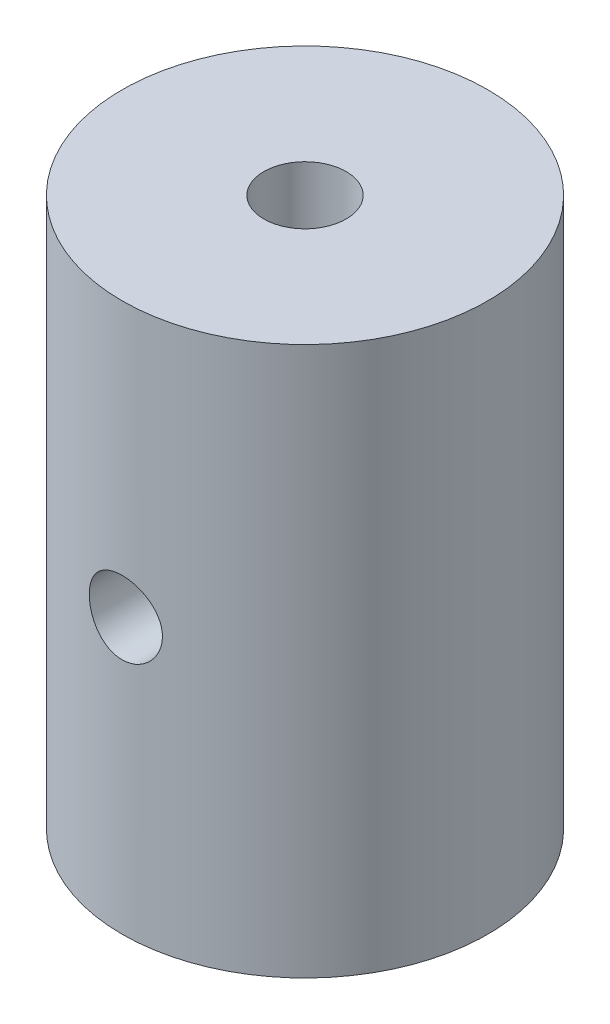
from build123d import *

# Parameters (mm, degrees)
SKETCH1_R          = 10
SKETCH1_R_2        = 2.25
EXTRUDE1_DEPTH     = 30
SKETCH2_R          = 2
CUT_EXTRUDE2_DEPTH = 30
SKETCH3_R          = 1.65
CUT_EXTRUDE3_DEPTH = 30


with BuildPart() as part:
    # Sketch1 → Extrude1 (new body)
    with BuildSketch(Plane(origin=(0, 0, 0), x_dir=(1, 0, 0), z_dir=(0, 1, 0))):
        with Locations(Location((0, 0, 0), (0, 0, 270))):
            Circle(SKETCH1_R)
        with Locations(Location((0, 0, 0), (0, 0, 270))):
            Circle(SKETCH1_R_2, mode=Mode.SUBTRACT)
    extrude(amount=EXTRUDE1_DEPTH)

    # Sketch2 → Cut-Extrude2 (cut)
    with BuildSketch(Plane.XY):
        with Locations(Location((0, 15, 0), (0, 0, 180))):
            Circle(SKETCH2_R)
    extrude(amount=CUT_EXTRUDE2_DEPTH, mode=Mode.SUBTRACT)

    # Sketch3 → Cut-Extrude3 (cut)
    with BuildSketch(Plane.XY):
        with Locations(Location((0, 15, 0), (0, 0, 90))):
            Circle(SKETCH3_R)
    extrude(amount=-CUT_EXTRUDE3_DEPTH, mode=Mode.SUBTRACT)


solid = part.part
